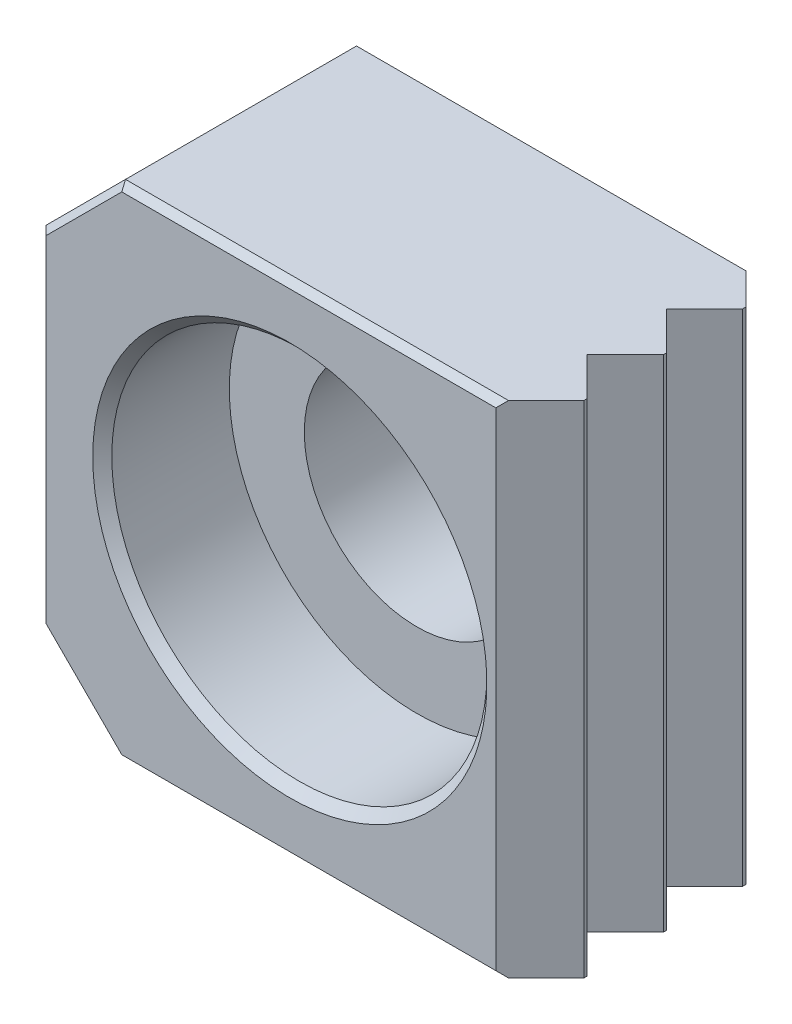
ISO-10303-21;
HEADER;
FILE_DESCRIPTION(('STEP AP214'),'2;1');
FILE_NAME('part.step','',(''),(''),'','','');
FILE_SCHEMA(('AUTOMOTIVE_DESIGN { 1 0 10303 214 1 1 1 1 }'));
ENDSEC;
DATA;
#1=APPLICATION_CONTEXT('core data for automotive mechanical design processes');
#2=APPLICATION_PROTOCOL_DEFINITION('international standard','automotive_design',2000,#1);
#3=PRODUCT_CONTEXT('',#1,'mechanical');
#4=PRODUCT('Part','Part','',(#3));
#5=PRODUCT_RELATED_PRODUCT_CATEGORY('part','',(#4));
#6=PRODUCT_DEFINITION_FORMATION('','',#4);
#7=PRODUCT_DEFINITION_CONTEXT('part definition',#1,'design');
#8=PRODUCT_DEFINITION('design','',#6,#7);
#9=PRODUCT_DEFINITION_SHAPE('','',#8);
#10=(LENGTH_UNIT() NAMED_UNIT(*) SI_UNIT(.MILLI.,.METRE.));
#11=(NAMED_UNIT(*) PLANE_ANGLE_UNIT() SI_UNIT($,.RADIAN.));
#12=(NAMED_UNIT(*) SI_UNIT($,.STERADIAN.) SOLID_ANGLE_UNIT());
#13=UNCERTAINTY_MEASURE_WITH_UNIT(LENGTH_MEASURE(1.E-05),#10,'distance_accuracy_value','');
#14=(GEOMETRIC_REPRESENTATION_CONTEXT(3) GLOBAL_UNCERTAINTY_ASSIGNED_CONTEXT((#13)) GLOBAL_UNIT_ASSIGNED_CONTEXT((#10,
#11,#12)) REPRESENTATION_CONTEXT('',''));
#15=CARTESIAN_POINT('',(0.,0.,0.));
#16=DIRECTION('',(0.,0.,1.));
#17=DIRECTION('',(1.,0.,0.));
#18=AXIS2_PLACEMENT_3D('',#15,#16,#17);
#19=CARTESIAN_POINT('',(10.,-10.,10.));
#20=DIRECTION('',(-1.,0.,0.));
#21=DIRECTION('',(0.,-1.,0.));
#22=AXIS2_PLACEMENT_3D('',#19,#20,#21);
#23=PLANE('',#22);
#24=DIRECTION('',(0.,-1.,0.));
#25=VECTOR('',#24,1.);
#26=CARTESIAN_POINT('',(10.,-10.,8.1115));
#27=LINE('',#26,#25);
#28=CARTESIAN_POINT('',(10.,10.,8.1115));
#29=VERTEX_POINT('',#28);
#30=CARTESIAN_POINT('',(10.,-10.,8.1115));
#31=VERTEX_POINT('',#30);
#32=EDGE_CURVE('E214',#29,#31,#27,.T.);
#33=ORIENTED_EDGE('',*,*,#32,.F.);
#34=DIRECTION('',(0.,0.,-1.));
#35=VECTOR('',#34,1.);
#36=CARTESIAN_POINT('',(10.,10.,10.));
#37=LINE('',#36,#35);
#38=CARTESIAN_POINT('',(10.,10.,8.2385));
#39=VERTEX_POINT('',#38);
#40=EDGE_CURVE('E226',#39,#29,#37,.T.);
#41=ORIENTED_EDGE('',*,*,#40,.F.);
#42=DIRECTION('',(0.,1.,0.));
#43=VECTOR('',#42,1.);
#44=CARTESIAN_POINT('',(10.,-10.,8.2385));
#45=LINE('',#44,#43);
#46=CARTESIAN_POINT('',(10.,-10.,8.2385));
#47=VERTEX_POINT('',#46);
#48=EDGE_CURVE('E207',#47,#39,#45,.T.);
#49=ORIENTED_EDGE('',*,*,#48,.F.);
#50=DIRECTION('',(0.,0.,-1.));
#51=VECTOR('',#50,1.);
#52=CARTESIAN_POINT('',(10.,-10.,10.));
#53=LINE('',#52,#51);
#54=EDGE_CURVE('E221',#47,#31,#53,.T.);
#55=ORIENTED_EDGE('',*,*,#54,.T.);
#56=EDGE_LOOP('',(#33,#41,#49,#55));
#57=FACE_BOUND('',#56,.T.);
#58=ADVANCED_FACE('F14',(#57),#23,.F.);
#59=CARTESIAN_POINT('',(10.,-10.,1.8885));
#60=VERTEX_POINT('',#59);
#61=CARTESIAN_POINT('',(10.,-10.,1.7615));
#62=VERTEX_POINT('',#61);
#63=EDGE_CURVE('E180',#60,#62,#53,.T.);
#64=ORIENTED_EDGE('',*,*,#63,.T.);
#65=DIRECTION('',(0.,1.,0.));
#66=VECTOR('',#65,1.);
#67=CARTESIAN_POINT('',(10.,-10.,1.7615));
#68=LINE('',#67,#66);
#69=CARTESIAN_POINT('',(10.,10.,1.7615));
#70=VERTEX_POINT('',#69);
#71=EDGE_CURVE('E172',#62,#70,#68,.T.);
#72=ORIENTED_EDGE('',*,*,#71,.T.);
#73=CARTESIAN_POINT('',(10.,10.,1.8885));
#74=VERTEX_POINT('',#73);
#75=EDGE_CURVE('E222',#74,#70,#37,.T.);
#76=ORIENTED_EDGE('',*,*,#75,.F.);
#77=DIRECTION('',(0.,-1.,0.));
#78=VECTOR('',#77,1.);
#79=CARTESIAN_POINT('',(10.,-10.,1.8885));
#80=LINE('',#79,#78);
#81=EDGE_CURVE('E212',#74,#60,#80,.T.);
#82=ORIENTED_EDGE('',*,*,#81,.T.);
#83=EDGE_LOOP('',(#64,#72,#76,#82));
#84=FACE_BOUND('',#83,.T.);
#85=ADVANCED_FACE('F312',(#84),#23,.F.);
#86=CARTESIAN_POINT('',(10.,-10.,5.0635));
#87=VERTEX_POINT('',#86);
#88=CARTESIAN_POINT('',(10.,-10.,4.9365));
#89=VERTEX_POINT('',#88);
#90=EDGE_CURVE('E220',#87,#89,#53,.T.);
#91=ORIENTED_EDGE('',*,*,#90,.T.);
#92=DIRECTION('',(0.,1.,0.));
#93=VECTOR('',#92,1.);
#94=CARTESIAN_POINT('',(10.,-10.,4.9365));
#95=LINE('',#94,#93);
#96=CARTESIAN_POINT('',(10.,10.,4.9365));
#97=VERTEX_POINT('',#96);
#98=EDGE_CURVE('E158',#89,#97,#95,.T.);
#99=ORIENTED_EDGE('',*,*,#98,.T.);
#100=CARTESIAN_POINT('',(10.,10.,5.0635));
#101=VERTEX_POINT('',#100);
#102=EDGE_CURVE('E225',#101,#97,#37,.T.);
#103=ORIENTED_EDGE('',*,*,#102,.F.);
#104=DIRECTION('',(0.,1.,0.));
#105=VECTOR('',#104,1.);
#106=CARTESIAN_POINT('',(10.,-10.,5.0635));
#107=LINE('',#106,#105);
#108=EDGE_CURVE('E209',#87,#101,#107,.T.);
#109=ORIENTED_EDGE('',*,*,#108,.F.);
#110=EDGE_LOOP('',(#91,#99,#103,#109));
#111=FACE_BOUND('',#110,.T.);
#112=ADVANCED_FACE('F314',(#111),#23,.F.);
#113=CARTESIAN_POINT('',(-10.,10.,10.));
#114=DIRECTION('',(0.,1.,0.));
#115=DIRECTION('',(-1.,0.,0.));
#116=AXIS2_PLACEMENT_3D('',#113,#114,#115);
#117=PLANE('',#116);
#118=DIRECTION('',(0.,0.,1.));
#119=VECTOR('',#118,1.);
#120=CARTESIAN_POINT('',(-6.825,10.,10.));
#121=LINE('',#120,#119);
#122=CARTESIAN_POINT('',(-6.825,10.,0.508));
#123=VERTEX_POINT('',#122);
#124=CARTESIAN_POINT('',(-6.825,10.,9.746));
#125=VERTEX_POINT('',#124);
#126=EDGE_CURVE('E239',#123,#125,#121,.T.);
#127=ORIENTED_EDGE('',*,*,#126,.T.);
#128=DIRECTION('',(1.,0.,0.));
#129=VECTOR('',#128,1.);
#130=CARTESIAN_POINT('',(8.23850000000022,10.,9.746));
#131=LINE('',#130,#129);
#132=CARTESIAN_POINT('',(8.4925000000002,10.,9.746));
#133=VERTEX_POINT('',#132);
#134=EDGE_CURVE('E295',#125,#133,#131,.T.);
#135=ORIENTED_EDGE('',*,*,#134,.T.);
#136=DIRECTION('',(-0.707106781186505,0.,0.70710678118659));
#137=VECTOR('',#136,1.);
#138=CARTESIAN_POINT('',(10.0635,10.,8.175));
#139=LINE('',#138,#137);
#140=EDGE_CURVE('E192',#39,#133,#139,.T.);
#141=ORIENTED_EDGE('',*,*,#140,.F.);
#142=ORIENTED_EDGE('',*,*,#40,.T.);
#143=DIRECTION('',(0.707106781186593,0.,0.707106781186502));
#144=VECTOR('',#143,1.);
#145=CARTESIAN_POINT('',(8.476,10.,6.58750000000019));
#146=LINE('',#145,#144);
#147=CARTESIAN_POINT('',(8.476,10.,6.58750000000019));
#148=VERTEX_POINT('',#147);
#149=EDGE_CURVE('E190',#148,#29,#146,.T.);
#150=ORIENTED_EDGE('',*,*,#149,.F.);
#151=DIRECTION('',(-0.707106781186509,0.,0.707106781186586));
#152=VECTOR('',#151,1.);
#153=CARTESIAN_POINT('',(10.0635,10.,5.));
#154=LINE('',#153,#152);
#155=EDGE_CURVE('E201',#101,#148,#154,.T.);
#156=ORIENTED_EDGE('',*,*,#155,.F.);
#157=ORIENTED_EDGE('',*,*,#102,.T.);
#158=DIRECTION('',(-0.707106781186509,0.,-0.707106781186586));
#159=VECTOR('',#158,1.);
#160=CARTESIAN_POINT('',(10.0635,10.,5.));
#161=LINE('',#160,#159);
#162=CARTESIAN_POINT('',(8.476,10.,3.41249999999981));
#163=VERTEX_POINT('',#162);
#164=EDGE_CURVE('E199',#97,#163,#161,.T.);
#165=ORIENTED_EDGE('',*,*,#164,.T.);
#166=DIRECTION('',(0.707106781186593,0.,-0.707106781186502));
#167=VECTOR('',#166,1.);
#168=CARTESIAN_POINT('',(8.476,10.,3.41249999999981));
#169=LINE('',#168,#167);
#170=EDGE_CURVE('E170',#163,#74,#169,.T.);
#171=ORIENTED_EDGE('',*,*,#170,.T.);
#172=ORIENTED_EDGE('',*,*,#75,.T.);
#173=DIRECTION('',(-0.707106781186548,0.,-0.707106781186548));
#174=VECTOR('',#173,1.);
#175=CARTESIAN_POINT('',(10.0635,10.,1.825));
#176=LINE('',#175,#174);
#177=CARTESIAN_POINT('',(8.7465,10.,0.508));
#178=VERTEX_POINT('',#177);
#179=EDGE_CURVE('E195',#70,#178,#176,.T.);
#180=ORIENTED_EDGE('',*,*,#179,.T.);
#181=DIRECTION('',(-1.,0.,0.));
#182=VECTOR('',#181,1.);
#183=CARTESIAN_POINT('',(-10.,10.,0.508));
#184=LINE('',#183,#182);
#185=EDGE_CURVE('E272',#178,#123,#184,.T.);
#186=ORIENTED_EDGE('',*,*,#185,.T.);
#187=EDGE_LOOP('',(#127,#135,#141,#142,#150,#156,#157,#165,#171,#172,#180,#186));
#188=FACE_BOUND('',#187,.T.);
#189=ADVANCED_FACE('F322',(#188),#117,.T.);
#190=CARTESIAN_POINT('',(10.,-10.,10.));
#191=DIRECTION('',(0.,-1.,0.));
#192=DIRECTION('',(1.,0.,0.));
#193=AXIS2_PLACEMENT_3D('',#190,#191,#192);
#194=PLANE('',#193);
#195=DIRECTION('',(-0.707106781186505,0.,0.70710678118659));
#196=VECTOR('',#195,1.);
#197=CARTESIAN_POINT('',(10.0635,-10.,8.175));
#198=LINE('',#197,#196);
#199=CARTESIAN_POINT('',(8.4925000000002,-10.,9.746));
#200=VERTEX_POINT('',#199);
#201=EDGE_CURVE('E184',#47,#200,#198,.T.);
#202=ORIENTED_EDGE('',*,*,#201,.T.);
#203=DIRECTION('',(-1.,0.,0.));
#204=VECTOR('',#203,1.);
#205=CARTESIAN_POINT('',(-6.825,-10.,9.746));
#206=LINE('',#205,#204);
#207=CARTESIAN_POINT('',(-6.825,-10.,9.746));
#208=VERTEX_POINT('',#207);
#209=EDGE_CURVE('E274',#200,#208,#206,.T.);
#210=ORIENTED_EDGE('',*,*,#209,.T.);
#211=DIRECTION('',(0.,0.,-1.));
#212=VECTOR('',#211,1.);
#213=CARTESIAN_POINT('',(-6.825,-10.,0.));
#214=LINE('',#213,#212);
#215=CARTESIAN_POINT('',(-6.825,-10.,0.508));
#216=VERTEX_POINT('',#215);
#217=EDGE_CURVE('E233',#208,#216,#214,.T.);
#218=ORIENTED_EDGE('',*,*,#217,.T.);
#219=DIRECTION('',(1.,0.,0.));
#220=VECTOR('',#219,1.);
#221=CARTESIAN_POINT('',(10.,-10.,0.508));
#222=LINE('',#221,#220);
#223=CARTESIAN_POINT('',(8.7465,-10.,0.508));
#224=VERTEX_POINT('',#223);
#225=EDGE_CURVE('E258',#216,#224,#222,.T.);
#226=ORIENTED_EDGE('',*,*,#225,.T.);
#227=DIRECTION('',(-0.707106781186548,0.,-0.707106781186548));
#228=VECTOR('',#227,1.);
#229=CARTESIAN_POINT('',(10.0635,-10.,1.825));
#230=LINE('',#229,#228);
#231=EDGE_CURVE('E181',#62,#224,#230,.T.);
#232=ORIENTED_EDGE('',*,*,#231,.F.);
#233=ORIENTED_EDGE('',*,*,#63,.F.);
#234=DIRECTION('',(0.707106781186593,0.,-0.707106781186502));
#235=VECTOR('',#234,1.);
#236=CARTESIAN_POINT('',(8.476,-10.,3.41249999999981));
#237=LINE('',#236,#235);
#238=CARTESIAN_POINT('',(8.476,-10.,3.41249999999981));
#239=VERTEX_POINT('',#238);
#240=EDGE_CURVE('E164',#239,#60,#237,.T.);
#241=ORIENTED_EDGE('',*,*,#240,.F.);
#242=DIRECTION('',(-0.707106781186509,0.,-0.707106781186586));
#243=VECTOR('',#242,1.);
#244=CARTESIAN_POINT('',(10.0635,-10.,5.));
#245=LINE('',#244,#243);
#246=EDGE_CURVE('E152',#89,#239,#245,.T.);
#247=ORIENTED_EDGE('',*,*,#246,.F.);
#248=ORIENTED_EDGE('',*,*,#90,.F.);
#249=DIRECTION('',(-0.707106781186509,0.,0.707106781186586));
#250=VECTOR('',#249,1.);
#251=CARTESIAN_POINT('',(10.0635,-10.,5.));
#252=LINE('',#251,#250);
#253=CARTESIAN_POINT('',(8.476,-10.,6.58750000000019));
#254=VERTEX_POINT('',#253);
#255=EDGE_CURVE('E163',#87,#254,#252,.T.);
#256=ORIENTED_EDGE('',*,*,#255,.T.);
#257=DIRECTION('',(0.707106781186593,0.,0.707106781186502));
#258=VECTOR('',#257,1.);
#259=CARTESIAN_POINT('',(8.476,-10.,6.58750000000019));
#260=LINE('',#259,#258);
#261=EDGE_CURVE('E338',#254,#31,#260,.T.);
#262=ORIENTED_EDGE('',*,*,#261,.T.);
#263=ORIENTED_EDGE('',*,*,#54,.F.);
#264=EDGE_LOOP('',(#202,#210,#218,#226,#232,#233,#241,#247,#248,#256,#262,#263));
#265=FACE_BOUND('',#264,.T.);
#266=ADVANCED_FACE('F177',(#265),#194,.T.);
#267=CARTESIAN_POINT('',(10.,10.,10.));
#268=DIRECTION('',(0.,0.,-1.));
#269=DIRECTION('',(1.,0.,0.));
#270=AXIS2_PLACEMENT_3D('',#267,#268,#269);
#271=PLANE('',#270);
#272=CARTESIAN_POINT('',(0.,0.,10.));
#273=DIRECTION('',(0.,0.,-1.));
#274=DIRECTION('',(-1.,0.,0.));
#275=AXIS2_PLACEMENT_3D('',#272,#273,#274);
#276=CIRCLE('',#275,7.881);
#277=CARTESIAN_POINT('',(-7.881,0.,10.));
#278=VERTEX_POINT('',#277);
#279=EDGE_CURVE('E9',#278,#278,#276,.T.);
#280=ORIENTED_EDGE('',*,*,#279,.T.);
#281=EDGE_LOOP('',(#280));
#282=FACE_BOUND('',#281,.T.);
#283=DIRECTION('',(0.707106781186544,-0.707106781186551,0.));
#284=VECTOR('',#283,1.);
#285=CARTESIAN_POINT('',(-6.64539487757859,-9.82039487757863,10.));
#286=LINE('',#285,#284);
#287=CARTESIAN_POINT('',(-9.746,-6.71978975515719,10.));
#288=VERTEX_POINT('',#287);
#289=CARTESIAN_POINT('',(-6.71978975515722,-9.746,10.));
#290=VERTEX_POINT('',#289);
#291=EDGE_CURVE('E283',#288,#290,#286,.T.);
#292=ORIENTED_EDGE('',*,*,#291,.T.);
#293=DIRECTION('',(1.,0.,0.));
#294=VECTOR('',#293,1.);
#295=CARTESIAN_POINT('',(8.23850000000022,-9.746,10.));
#296=LINE('',#295,#294);
#297=CARTESIAN_POINT('',(8.23850000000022,-9.746,10.));
#298=VERTEX_POINT('',#297);
#299=EDGE_CURVE('E285',#290,#298,#296,.T.);
#300=ORIENTED_EDGE('',*,*,#299,.T.);
#301=DIRECTION('',(0.,-1.,0.));
#302=VECTOR('',#301,1.);
#303=CARTESIAN_POINT('',(8.23850000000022,10.,10.));
#304=LINE('',#303,#302);
#305=CARTESIAN_POINT('',(8.23850000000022,9.746,10.));
#306=VERTEX_POINT('',#305);
#307=EDGE_CURVE('E230',#306,#298,#304,.T.);
#308=ORIENTED_EDGE('',*,*,#307,.F.);
#309=DIRECTION('',(-1.,0.,0.));
#310=VECTOR('',#309,1.);
#311=CARTESIAN_POINT('',(-6.825,9.746,10.));
#312=LINE('',#311,#310);
#313=CARTESIAN_POINT('',(-6.71978975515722,9.746,10.));
#314=VERTEX_POINT('',#313);
#315=EDGE_CURVE('E277',#306,#314,#312,.T.);
#316=ORIENTED_EDGE('',*,*,#315,.T.);
#317=DIRECTION('',(-0.707106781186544,-0.707106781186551,0.));
#318=VECTOR('',#317,1.);
#319=CARTESIAN_POINT('',(-9.82039487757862,6.64539487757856,10.));
#320=LINE('',#319,#318);
#321=CARTESIAN_POINT('',(-9.746,6.71978975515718,10.));
#322=VERTEX_POINT('',#321);
#323=EDGE_CURVE('E279',#314,#322,#320,.T.);
#324=ORIENTED_EDGE('',*,*,#323,.T.);
#325=DIRECTION('',(0.,-1.,0.));
#326=VECTOR('',#325,1.);
#327=CARTESIAN_POINT('',(-9.746,10.,10.));
#328=LINE('',#327,#326);
#329=EDGE_CURVE('E281',#322,#288,#328,.T.);
#330=ORIENTED_EDGE('',*,*,#329,.T.);
#331=EDGE_LOOP('',(#292,#300,#308,#316,#324,#330));
#332=FACE_BOUND('',#331,.T.);
#333=ADVANCED_FACE('F388',(#282,#332),#271,.F.);
#334=CARTESIAN_POINT('',(-10.,10.,10.));
#335=DIRECTION('',(1.,0.,0.));
#336=DIRECTION('',(0.,0.,1.));
#337=AXIS2_PLACEMENT_3D('',#334,#335,#336);
#338=PLANE('',#337);
#339=DIRECTION('',(0.,0.,1.));
#340=VECTOR('',#339,1.);
#341=CARTESIAN_POINT('',(-10.,-6.825,10.));
#342=LINE('',#341,#340);
#343=CARTESIAN_POINT('',(-10.,-6.825,0.508));
#344=VERTEX_POINT('',#343);
#345=CARTESIAN_POINT('',(-10.,-6.825,9.746));
#346=VERTEX_POINT('',#345);
#347=EDGE_CURVE('E237',#344,#346,#342,.T.);
#348=ORIENTED_EDGE('',*,*,#347,.T.);
#349=DIRECTION('',(0.,1.,0.));
#350=VECTOR('',#349,1.);
#351=CARTESIAN_POINT('',(-10.,10.,9.746));
#352=LINE('',#351,#350);
#353=CARTESIAN_POINT('',(-10.,6.825,9.746));
#354=VERTEX_POINT('',#353);
#355=EDGE_CURVE('E37',#346,#354,#352,.T.);
#356=ORIENTED_EDGE('',*,*,#355,.T.);
#357=DIRECTION('',(0.,0.,-1.));
#358=VECTOR('',#357,1.);
#359=CARTESIAN_POINT('',(-10.,6.825,0.));
#360=LINE('',#359,#358);
#361=CARTESIAN_POINT('',(-10.,6.825,0.508));
#362=VERTEX_POINT('',#361);
#363=EDGE_CURVE('E235',#354,#362,#360,.T.);
#364=ORIENTED_EDGE('',*,*,#363,.T.);
#365=DIRECTION('',(0.,-1.,0.));
#366=VECTOR('',#365,1.);
#367=CARTESIAN_POINT('',(-10.,-6.825,0.508));
#368=LINE('',#367,#366);
#369=EDGE_CURVE('E267',#362,#344,#368,.T.);
#370=ORIENTED_EDGE('',*,*,#369,.T.);
#371=EDGE_LOOP('',(#348,#356,#364,#370));
#372=FACE_BOUND('',#371,.T.);
#373=ADVANCED_FACE('F382',(#372),#338,.F.);
#374=CARTESIAN_POINT('',(10.,10.,0.));
#375=DIRECTION('',(0.,0.,-1.));
#376=DIRECTION('',(1.,0.,0.));
#377=AXIS2_PLACEMENT_3D('',#374,#375,#376);
#378=PLANE('',#377);
#379=CARTESIAN_POINT('',(0.,0.,0.));
#380=DIRECTION('',(0.,0.,-1.));
#381=DIRECTION('',(1.,0.,0.));
#382=AXIS2_PLACEMENT_3D('',#379,#380,#381);
#383=CIRCLE('',#382,4.881);
#384=CARTESIAN_POINT('',(4.881,0.,0.));
#385=VERTEX_POINT('',#384);
#386=EDGE_CURVE('E241',#385,#385,#383,.F.);
#387=ORIENTED_EDGE('',*,*,#386,.T.);
#388=EDGE_LOOP('',(#387));
#389=FACE_BOUND('',#388,.T.);
#390=DIRECTION('',(0.,1.,0.));
#391=VECTOR('',#390,1.);
#392=CARTESIAN_POINT('',(8.2385,10.,0.));
#393=LINE('',#392,#391);
#394=CARTESIAN_POINT('',(8.2385,-9.492,0.));
#395=VERTEX_POINT('',#394);
#396=CARTESIAN_POINT('',(8.2385,9.492,0.));
#397=VERTEX_POINT('',#396);
#398=EDGE_CURVE('E227',#395,#397,#393,.T.);
#399=ORIENTED_EDGE('',*,*,#398,.F.);
#400=DIRECTION('',(-1.,0.,0.));
#401=VECTOR('',#400,1.);
#402=CARTESIAN_POINT('',(10.,-9.492,0.));
#403=LINE('',#402,#401);
#404=CARTESIAN_POINT('',(-6.61457951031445,-9.492,0.));
#405=VERTEX_POINT('',#404);
#406=EDGE_CURVE('E255',#395,#405,#403,.T.);
#407=ORIENTED_EDGE('',*,*,#406,.T.);
#408=DIRECTION('',(-0.707106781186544,0.707106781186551,0.));
#409=VECTOR('',#408,1.);
#410=CARTESIAN_POINT('',(-8.05328975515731,-8.05328975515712,0.));
#411=LINE('',#410,#409);
#412=CARTESIAN_POINT('',(-9.492,-6.61457951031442,0.));
#413=VERTEX_POINT('',#412);
#414=EDGE_CURVE('E253',#405,#413,#411,.T.);
#415=ORIENTED_EDGE('',*,*,#414,.T.);
#416=DIRECTION('',(0.,1.,0.));
#417=VECTOR('',#416,1.);
#418=CARTESIAN_POINT('',(-9.492,6.825,0.));
#419=LINE('',#418,#417);
#420=CARTESIAN_POINT('',(-9.492,6.61457951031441,0.));
#421=VERTEX_POINT('',#420);
#422=EDGE_CURVE('E251',#413,#421,#419,.T.);
#423=ORIENTED_EDGE('',*,*,#422,.T.);
#424=DIRECTION('',(0.707106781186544,0.707106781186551,0.));
#425=VECTOR('',#424,1.);
#426=CARTESIAN_POINT('',(1.9467102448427,18.0532897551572,0.));
#427=LINE('',#426,#425);
#428=CARTESIAN_POINT('',(-6.61457951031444,9.492,0.));
#429=VERTEX_POINT('',#428);
#430=EDGE_CURVE('E249',#421,#429,#427,.T.);
#431=ORIENTED_EDGE('',*,*,#430,.T.);
#432=DIRECTION('',(1.,0.,0.));
#433=VECTOR('',#432,1.);
#434=CARTESIAN_POINT('',(10.,9.492,0.));
#435=LINE('',#434,#433);
#436=EDGE_CURVE('E247',#429,#397,#435,.T.);
#437=ORIENTED_EDGE('',*,*,#436,.T.);
#438=EDGE_LOOP('',(#399,#407,#415,#423,#431,#437));
#439=FACE_BOUND('',#438,.T.);
#440=ADVANCED_FACE('F372',(#389,#439),#378,.T.);
#441=CARTESIAN_POINT('',(0.,0.,4.92));
#442=DIRECTION('',(0.,0.,1.));
#443=DIRECTION('',(-1.,0.,0.));
#444=AXIS2_PLACEMENT_3D('',#441,#442,#443);
#445=PLANE('',#444);
#446=CARTESIAN_POINT('',(0.,0.,4.92));
#447=DIRECTION('',(0.,0.,1.));
#448=DIRECTION('',(-1.,0.,0.));
#449=AXIS2_PLACEMENT_3D('',#446,#447,#448);
#450=CIRCLE('',#449,4.5);
#451=CARTESIAN_POINT('',(-4.5,0.,4.92));
#452=VERTEX_POINT('',#451);
#453=EDGE_CURVE('E216',#452,#452,#450,.T.);
#454=ORIENTED_EDGE('',*,*,#453,.F.);
#455=EDGE_LOOP('',(#454));
#456=FACE_BOUND('',#455,.T.);
#457=CARTESIAN_POINT('',(0.,0.,4.92));
#458=DIRECTION('',(0.,0.,1.));
#459=DIRECTION('',(1.,0.,0.));
#460=AXIS2_PLACEMENT_3D('',#457,#458,#459);
#461=CIRCLE('',#460,7.5);
#462=CARTESIAN_POINT('',(7.5,0.,4.92));
#463=VERTEX_POINT('',#462);
#464=EDGE_CURVE('E365',#463,#463,#461,.F.);
#465=ORIENTED_EDGE('',*,*,#464,.F.);
#466=EDGE_LOOP('',(#465));
#467=FACE_BOUND('',#466,.T.);
#468=ADVANCED_FACE('F369',(#456,#467),#445,.T.);
#469=CARTESIAN_POINT('',(0.,0.,0.));
#470=DIRECTION('',(0.,0.,1.));
#471=DIRECTION('',(-1.,0.,0.));
#472=AXIS2_PLACEMENT_3D('',#469,#470,#471);
#473=CYLINDRICAL_SURFACE('',#472,4.5);
#474=CARTESIAN_POINT('',(0.,0.,0.381));
#475=DIRECTION('',(0.,0.,-1.));
#476=DIRECTION('',(1.,0.,0.));
#477=AXIS2_PLACEMENT_3D('',#474,#475,#476);
#478=CIRCLE('',#477,4.5);
#479=CARTESIAN_POINT('',(4.5,0.,0.381));
#480=VERTEX_POINT('',#479);
#481=EDGE_CURVE('E244',#480,#480,#478,.T.);
#482=ORIENTED_EDGE('',*,*,#481,.T.);
#483=EDGE_LOOP('',(#482));
#484=FACE_BOUND('',#483,.T.);
#485=ORIENTED_EDGE('',*,*,#453,.T.);
#486=EDGE_LOOP('',(#485));
#487=FACE_BOUND('',#486,.T.);
#488=ADVANCED_FACE('F371',(#484,#487),#473,.F.);
#489=CARTESIAN_POINT('',(10.0635,10.,1.825));
#490=DIRECTION('',(-0.707106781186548,0.,0.707106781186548));
#491=DIRECTION('',(-0.707106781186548,0.,-0.707106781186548));
#492=AXIS2_PLACEMENT_3D('',#489,#490,#491);
#493=PLANE('',#492);
#494=ORIENTED_EDGE('',*,*,#231,.T.);
#495=DIRECTION('',(0.577350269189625,-0.577350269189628,0.577350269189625));
#496=VECTOR('',#495,1.);
#497=CARTESIAN_POINT('',(8.82566666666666,-10.0791666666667,0.587166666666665));
#498=LINE('',#497,#496);
#499=EDGE_CURVE('E262',#224,#395,#498,.F.);
#500=ORIENTED_EDGE('',*,*,#499,.T.);
#501=ORIENTED_EDGE('',*,*,#398,.T.);
#502=DIRECTION('',(-0.577350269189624,-0.57735026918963,-0.577350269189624));
#503=VECTOR('',#502,1.);
#504=CARTESIAN_POINT('',(8.82566666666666,10.0791666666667,0.587166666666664));
#505=LINE('',#504,#503);
#506=EDGE_CURVE('E260',#397,#178,#505,.F.);
#507=ORIENTED_EDGE('',*,*,#506,.T.);
#508=ORIENTED_EDGE('',*,*,#179,.F.);
#509=ORIENTED_EDGE('',*,*,#71,.F.);
#510=EDGE_LOOP('',(#494,#500,#501,#507,#508,#509));
#511=FACE_BOUND('',#510,.T.);
#512=ADVANCED_FACE('F379',(#511),#493,.F.);
#513=CARTESIAN_POINT('',(10.0635,10.,8.175));
#514=DIRECTION('',(0.70710678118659,0.,0.707106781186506));
#515=DIRECTION('',(-0.707106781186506,0.,0.70710678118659));
#516=AXIS2_PLACEMENT_3D('',#513,#514,#515);
#517=PLANE('',#516);
#518=ORIENTED_EDGE('',*,*,#307,.T.);
#519=DIRECTION('',(0.577350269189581,-0.577350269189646,-0.57735026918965));
#520=VECTOR('',#519,1.);
#521=CARTESIAN_POINT('',(2.87316666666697,-4.38066666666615,15.3653333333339));
#522=LINE('',#521,#520);
#523=EDGE_CURVE('E289',#298,#200,#522,.T.);
#524=ORIENTED_EDGE('',*,*,#523,.T.);
#525=ORIENTED_EDGE('',*,*,#201,.F.);
#526=ORIENTED_EDGE('',*,*,#48,.T.);
#527=ORIENTED_EDGE('',*,*,#140,.T.);
#528=DIRECTION('',(-0.577350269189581,-0.577350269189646,0.57735026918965));
#529=VECTOR('',#528,1.);
#530=CARTESIAN_POINT('',(9.53983333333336,11.0473333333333,8.6986666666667));
#531=LINE('',#530,#529);
#532=EDGE_CURVE('E287',#133,#306,#531,.T.);
#533=ORIENTED_EDGE('',*,*,#532,.T.);
#534=EDGE_LOOP('',(#518,#524,#525,#526,#527,#533));
#535=FACE_BOUND('',#534,.T.);
#536=ADVANCED_FACE('F417',(#535),#517,.T.);
#537=CARTESIAN_POINT('',(10.0635,10.,5.));
#538=DIRECTION('',(0.707106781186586,0.,0.707106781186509));
#539=DIRECTION('',(-0.707106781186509,0.,0.707106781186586));
#540=AXIS2_PLACEMENT_3D('',#537,#538,#539);
#541=PLANE('',#540);
#542=ORIENTED_EDGE('',*,*,#108,.T.);
#543=ORIENTED_EDGE('',*,*,#155,.T.);
#544=DIRECTION('',(0.,-1.,0.));
#545=VECTOR('',#544,1.);
#546=CARTESIAN_POINT('',(8.476,10.,6.58750000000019));
#547=LINE('',#546,#545);
#548=EDGE_CURVE('E173',#148,#254,#547,.T.);
#549=ORIENTED_EDGE('',*,*,#548,.T.);
#550=ORIENTED_EDGE('',*,*,#255,.F.);
#551=EDGE_LOOP('',(#542,#543,#549,#550));
#552=FACE_BOUND('',#551,.T.);
#553=ADVANCED_FACE('F467',(#552),#541,.T.);
#554=CARTESIAN_POINT('',(8.476,10.,6.58750000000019));
#555=DIRECTION('',(0.707106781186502,0.,-0.707106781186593));
#556=DIRECTION('',(0.707106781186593,0.,0.707106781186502));
#557=AXIS2_PLACEMENT_3D('',#554,#555,#556);
#558=PLANE('',#557);
#559=ORIENTED_EDGE('',*,*,#32,.T.);
#560=ORIENTED_EDGE('',*,*,#261,.F.);
#561=ORIENTED_EDGE('',*,*,#548,.F.);
#562=ORIENTED_EDGE('',*,*,#149,.T.);
#563=EDGE_LOOP('',(#559,#560,#561,#562));
#564=FACE_BOUND('',#563,.T.);
#565=ADVANCED_FACE('F470',(#564),#558,.T.);
#566=CARTESIAN_POINT('',(8.476,10.,3.41249999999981));
#567=DIRECTION('',(-0.707106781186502,0.,-0.707106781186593));
#568=DIRECTION('',(0.707106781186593,0.,-0.707106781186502));
#569=AXIS2_PLACEMENT_3D('',#566,#567,#568);
#570=PLANE('',#569);
#571=ORIENTED_EDGE('',*,*,#170,.F.);
#572=DIRECTION('',(0.,-1.,0.));
#573=VECTOR('',#572,1.);
#574=CARTESIAN_POINT('',(8.476,10.,3.41249999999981));
#575=LINE('',#574,#573);
#576=EDGE_CURVE('E155',#163,#239,#575,.T.);
#577=ORIENTED_EDGE('',*,*,#576,.T.);
#578=ORIENTED_EDGE('',*,*,#240,.T.);
#579=ORIENTED_EDGE('',*,*,#81,.F.);
#580=EDGE_LOOP('',(#571,#577,#578,#579));
#581=FACE_BOUND('',#580,.T.);
#582=ADVANCED_FACE('F167',(#581),#570,.F.);
#583=CARTESIAN_POINT('',(10.0635,10.,5.));
#584=DIRECTION('',(-0.707106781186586,0.,0.707106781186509));
#585=DIRECTION('',(-0.707106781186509,0.,-0.707106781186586));
#586=AXIS2_PLACEMENT_3D('',#583,#584,#585);
#587=PLANE('',#586);
#588=ORIENTED_EDGE('',*,*,#246,.T.);
#589=ORIENTED_EDGE('',*,*,#576,.F.);
#590=ORIENTED_EDGE('',*,*,#164,.F.);
#591=ORIENTED_EDGE('',*,*,#98,.F.);
#592=EDGE_LOOP('',(#588,#589,#590,#591));
#593=FACE_BOUND('',#592,.T.);
#594=ADVANCED_FACE('F154',(#593),#587,.F.);
#595=CARTESIAN_POINT('',(-6.825,-10.,10.));
#596=DIRECTION('',(-0.707106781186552,-0.707106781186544,0.));
#597=DIRECTION('',(0.707106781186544,-0.707106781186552,0.));
#598=AXIS2_PLACEMENT_3D('',#595,#596,#597);
#599=PLANE('',#598);
#600=ORIENTED_EDGE('',*,*,#217,.F.);
#601=DIRECTION('',(-0.707106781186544,0.707106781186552,0.));
#602=VECTOR('',#601,1.);
#603=CARTESIAN_POINT('',(-10.,-6.825,9.746));
#604=LINE('',#603,#602);
#605=EDGE_CURVE('E291',#208,#346,#604,.T.);
#606=ORIENTED_EDGE('',*,*,#605,.T.);
#607=ORIENTED_EDGE('',*,*,#347,.F.);
#608=DIRECTION('',(0.707106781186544,-0.707106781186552,0.));
#609=VECTOR('',#608,1.);
#610=CARTESIAN_POINT('',(-6.825,-10.,0.508));
#611=LINE('',#610,#609);
#612=EDGE_CURVE('E264',#344,#216,#611,.T.);
#613=ORIENTED_EDGE('',*,*,#612,.T.);
#614=EDGE_LOOP('',(#600,#606,#607,#613));
#615=FACE_BOUND('',#614,.T.);
#616=ADVANCED_FACE('F464',(#615),#599,.T.);
#617=CARTESIAN_POINT('',(-10.,6.825,10.));
#618=DIRECTION('',(-0.707106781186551,0.707106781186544,0.));
#619=DIRECTION('',(-0.707106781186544,-0.707106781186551,0.));
#620=AXIS2_PLACEMENT_3D('',#617,#618,#619);
#621=PLANE('',#620);
#622=ORIENTED_EDGE('',*,*,#363,.F.);
#623=DIRECTION('',(0.707106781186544,0.707106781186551,0.));
#624=VECTOR('',#623,1.);
#625=CARTESIAN_POINT('',(-6.825,10.,9.746));
#626=LINE('',#625,#624);
#627=EDGE_CURVE('E29',#354,#125,#626,.T.);
#628=ORIENTED_EDGE('',*,*,#627,.T.);
#629=ORIENTED_EDGE('',*,*,#126,.F.);
#630=DIRECTION('',(-0.707106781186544,-0.707106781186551,0.));
#631=VECTOR('',#630,1.);
#632=CARTESIAN_POINT('',(-10.,6.825,0.508));
#633=LINE('',#632,#631);
#634=EDGE_CURVE('E269',#123,#362,#633,.T.);
#635=ORIENTED_EDGE('',*,*,#634,.T.);
#636=EDGE_LOOP('',(#622,#628,#629,#635));
#637=FACE_BOUND('',#636,.T.);
#638=ADVANCED_FACE('F460',(#637),#621,.T.);
#639=CARTESIAN_POINT('',(0.,0.,0.));
#640=DIRECTION('',(0.,0.,-1.));
#641=DIRECTION('',(1.,0.,0.));
#642=AXIS2_PLACEMENT_3D('',#639,#640,#641);
#643=CONICAL_SURFACE('',#642,4.881,0.785398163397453);
#644=ORIENTED_EDGE('',*,*,#481,.F.);
#645=EDGE_LOOP('',(#644));
#646=FACE_BOUND('',#645,.T.);
#647=ORIENTED_EDGE('',*,*,#386,.F.);
#648=EDGE_LOOP('',(#647));
#649=FACE_BOUND('',#648,.T.);
#650=ADVANCED_FACE('F456',(#646,#649),#643,.F.);
#651=CARTESIAN_POINT('',(10.,9.492,0.));
#652=DIRECTION('',(0.,-0.707106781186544,0.707106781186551));
#653=DIRECTION('',(0.,-0.707106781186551,-0.707106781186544));
#654=AXIS2_PLACEMENT_3D('',#651,#652,#653);
#655=PLANE('',#654);
#656=ORIENTED_EDGE('',*,*,#506,.F.);
#657=ORIENTED_EDGE('',*,*,#436,.F.);
#658=DIRECTION('',(-0.281084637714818,0.678598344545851,0.678598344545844));
#659=VECTOR('',#658,1.);
#660=CARTESIAN_POINT('',(-5.30188528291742,6.32287579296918,-3.16912420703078));
#661=LINE('',#660,#659);
#662=EDGE_CURVE('E341',#123,#429,#661,.F.);
#663=ORIENTED_EDGE('',*,*,#662,.F.);
#664=ORIENTED_EDGE('',*,*,#185,.F.);
#665=EDGE_LOOP('',(#656,#657,#663,#664));
#666=FACE_BOUND('',#665,.T.);
#667=ADVANCED_FACE('F452',(#666),#655,.F.);
#668=CARTESIAN_POINT('',(1.9467102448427,18.0532897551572,0.));
#669=DIRECTION('',(0.5,-0.5,0.707106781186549));
#670=DIRECTION('',(-0.816496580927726,0.,0.577350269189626));
#671=AXIS2_PLACEMENT_3D('',#668,#669,#670);
#672=PLANE('',#671);
#673=ORIENTED_EDGE('',*,*,#662,.T.);
#674=ORIENTED_EDGE('',*,*,#430,.F.);
#675=DIRECTION('',(0.678598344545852,-0.281084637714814,-0.678598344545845));
#676=VECTOR('',#675,1.);
#677=CARTESIAN_POINT('',(-6.40638339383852,5.33647526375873,-3.08561660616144));
#678=LINE('',#677,#676);
#679=EDGE_CURVE('E344',#362,#421,#678,.T.);
#680=ORIENTED_EDGE('',*,*,#679,.F.);
#681=ORIENTED_EDGE('',*,*,#634,.F.);
#682=EDGE_LOOP('',(#673,#674,#680,#681));
#683=FACE_BOUND('',#682,.T.);
#684=ADVANCED_FACE('F448',(#683),#672,.F.);
#685=CARTESIAN_POINT('',(-10.,10.,0.508));
#686=DIRECTION('',(-0.707106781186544,0.,-0.707106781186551));
#687=DIRECTION('',(0.707106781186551,0.,-0.707106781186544));
#688=AXIS2_PLACEMENT_3D('',#685,#686,#687);
#689=PLANE('',#688);
#690=ORIENTED_EDGE('',*,*,#679,.T.);
#691=ORIENTED_EDGE('',*,*,#422,.F.);
#692=DIRECTION('',(0.678598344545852,0.281084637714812,-0.678598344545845));
#693=VECTOR('',#692,1.);
#694=CARTESIAN_POINT('',(-6.79073943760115,-5.49568074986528,-2.70126056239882));
#695=LINE('',#694,#693);
#696=EDGE_CURVE('E349',#344,#413,#695,.T.);
#697=ORIENTED_EDGE('',*,*,#696,.F.);
#698=ORIENTED_EDGE('',*,*,#369,.F.);
#699=EDGE_LOOP('',(#690,#691,#697,#698));
#700=FACE_BOUND('',#699,.T.);
#701=ADVANCED_FACE('F444',(#700),#689,.T.);
#702=CARTESIAN_POINT('',(-8.05328975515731,-8.05328975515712,0.));
#703=DIRECTION('',(0.5,0.5,0.707106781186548));
#704=DIRECTION('',(-0.816496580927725,0.,0.577350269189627));
#705=AXIS2_PLACEMENT_3D('',#702,#703,#704);
#706=PLANE('',#705);
#707=ORIENTED_EDGE('',*,*,#696,.T.);
#708=ORIENTED_EDGE('',*,*,#414,.F.);
#709=DIRECTION('',(-0.281084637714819,-0.67859834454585,0.678598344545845));
#710=VECTOR('',#709,1.);
#711=CARTESIAN_POINT('',(-6.45382522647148,-9.10390482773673,-0.388095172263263));
#712=LINE('',#711,#710);
#713=EDGE_CURVE('E352',#216,#405,#712,.F.);
#714=ORIENTED_EDGE('',*,*,#713,.F.);
#715=ORIENTED_EDGE('',*,*,#612,.F.);
#716=EDGE_LOOP('',(#707,#708,#714,#715));
#717=FACE_BOUND('',#716,.T.);
#718=ADVANCED_FACE('F440',(#717),#706,.F.);
#719=CARTESIAN_POINT('',(10.,-9.492,0.));
#720=DIRECTION('',(0.,0.707106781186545,0.70710678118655));
#721=DIRECTION('',(0.,-0.70710678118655,0.707106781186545));
#722=AXIS2_PLACEMENT_3D('',#719,#720,#721);
#723=PLANE('',#722);
#724=ORIENTED_EDGE('',*,*,#499,.F.);
#725=ORIENTED_EDGE('',*,*,#225,.F.);
#726=ORIENTED_EDGE('',*,*,#713,.T.);
#727=ORIENTED_EDGE('',*,*,#406,.F.);
#728=EDGE_LOOP('',(#724,#725,#726,#727));
#729=FACE_BOUND('',#728,.T.);
#730=ADVANCED_FACE('F434',(#729),#723,.F.);
#731=CARTESIAN_POINT('',(-10.,10.,9.746));
#732=DIRECTION('',(0.,0.70710678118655,0.707106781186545));
#733=DIRECTION('',(0.,-0.707106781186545,0.70710678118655));
#734=AXIS2_PLACEMENT_3D('',#731,#732,#733);
#735=PLANE('',#734);
#736=ORIENTED_EDGE('',*,*,#532,.F.);
#737=ORIENTED_EDGE('',*,*,#134,.F.);
#738=DIRECTION('',(0.28108463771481,-0.678598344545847,0.678598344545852));
#739=VECTOR('',#738,1.);
#740=CARTESIAN_POINT('',(-7.07585222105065,10.605610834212,9.14038916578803));
#741=LINE('',#740,#739);
#742=EDGE_CURVE('E354',#314,#125,#741,.F.);
#743=ORIENTED_EDGE('',*,*,#742,.F.);
#744=ORIENTED_EDGE('',*,*,#315,.F.);
#745=EDGE_LOOP('',(#736,#737,#743,#744));
#746=FACE_BOUND('',#745,.T.);
#747=ADVANCED_FACE('F422',(#746),#735,.T.);
#748=CARTESIAN_POINT('',(1.76710512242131,18.2328948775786,10.));
#749=DIRECTION('',(-0.500000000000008,0.5,0.70710678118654));
#750=DIRECTION('',(-0.816496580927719,0.,-0.577350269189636));
#751=AXIS2_PLACEMENT_3D('',#748,#749,#750);
#752=PLANE('',#751);
#753=ORIENTED_EDGE('',*,*,#742,.T.);
#754=ORIENTED_EDGE('',*,*,#627,.F.);
#755=DIRECTION('',(-0.678598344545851,0.2810846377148,-0.678598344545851));
#756=VECTOR('',#755,1.);
#757=CARTESIAN_POINT('',(-6.64031521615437,5.43337299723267,13.1056847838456));
#758=LINE('',#757,#756);
#759=EDGE_CURVE('E357',#322,#354,#758,.T.);
#760=ORIENTED_EDGE('',*,*,#759,.F.);
#761=ORIENTED_EDGE('',*,*,#323,.F.);
#762=EDGE_LOOP('',(#753,#754,#760,#761));
#763=FACE_BOUND('',#762,.T.);
#764=ADVANCED_FACE('F426',(#763),#752,.T.);
#765=CARTESIAN_POINT('',(-9.746,10.,10.));
#766=DIRECTION('',(0.707106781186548,0.,-0.707106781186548));
#767=DIRECTION('',(0.707106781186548,0.,0.707106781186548));
#768=AXIS2_PLACEMENT_3D('',#765,#766,#767);
#769=PLANE('',#768);
#770=ORIENTED_EDGE('',*,*,#759,.T.);
#771=ORIENTED_EDGE('',*,*,#355,.F.);
#772=DIRECTION('',(-0.678598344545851,-0.2810846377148,-0.678598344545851));
#773=VECTOR('',#772,1.);
#774=CARTESIAN_POINT('',(-6.55680761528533,-5.39878301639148,13.1891923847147));
#775=LINE('',#774,#773);
#776=EDGE_CURVE('E360',#288,#346,#775,.T.);
#777=ORIENTED_EDGE('',*,*,#776,.F.);
#778=ORIENTED_EDGE('',*,*,#329,.F.);
#779=EDGE_LOOP('',(#770,#771,#777,#778));
#780=FACE_BOUND('',#779,.T.);
#781=ADVANCED_FACE('F403',(#780),#769,.F.);
#782=CARTESIAN_POINT('',(-8.2328948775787,-8.2328948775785,10.));
#783=DIRECTION('',(-0.500000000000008,-0.5,0.70710678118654));
#784=DIRECTION('',(-0.816496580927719,0.,-0.577350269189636));
#785=AXIS2_PLACEMENT_3D('',#782,#783,#784);
#786=PLANE('',#785);
#787=ORIENTED_EDGE('',*,*,#776,.T.);
#788=ORIENTED_EDGE('',*,*,#605,.F.);
#789=DIRECTION('',(0.281084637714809,0.678598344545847,0.678598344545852));
#790=VECTOR('',#789,1.);
#791=CARTESIAN_POINT('',(-6.55072295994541,-9.33783665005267,10.4081633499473));
#792=LINE('',#791,#790);
#793=EDGE_CURVE('E363',#290,#208,#792,.F.);
#794=ORIENTED_EDGE('',*,*,#793,.F.);
#795=ORIENTED_EDGE('',*,*,#291,.F.);
#796=EDGE_LOOP('',(#787,#788,#794,#795));
#797=FACE_BOUND('',#796,.T.);
#798=ADVANCED_FACE('F409',(#797),#786,.T.);
#799=CARTESIAN_POINT('',(10.,-10.,9.746));
#800=DIRECTION('',(0.,-0.70710678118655,0.707106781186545));
#801=DIRECTION('',(0.,-0.707106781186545,-0.70710678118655));
#802=AXIS2_PLACEMENT_3D('',#799,#800,#801);
#803=PLANE('',#802);
#804=ORIENTED_EDGE('',*,*,#523,.F.);
#805=ORIENTED_EDGE('',*,*,#299,.F.);
#806=ORIENTED_EDGE('',*,*,#793,.T.);
#807=ORIENTED_EDGE('',*,*,#209,.F.);
#808=EDGE_LOOP('',(#804,#805,#806,#807));
#809=FACE_BOUND('',#808,.T.);
#810=ADVANCED_FACE('F308',(#809),#803,.T.);
#811=CARTESIAN_POINT('',(0.,0.,-16.2932034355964));
#812=DIRECTION('',(0.,0.,1.));
#813=DIRECTION('',(1.,0.,0.));
#814=AXIS2_PLACEMENT_3D('',#811,#812,#813);
#815=CYLINDRICAL_SURFACE('',#814,7.5);
#816=CARTESIAN_POINT('',(0.,0.,9.619));
#817=DIRECTION('',(0.,0.,-1.));
#818=DIRECTION('',(-1.,0.,0.));
#819=AXIS2_PLACEMENT_3D('',#816,#817,#818);
#820=CIRCLE('',#819,7.5);
#821=CARTESIAN_POINT('',(-7.5,0.,9.619));
#822=VERTEX_POINT('',#821);
#823=EDGE_CURVE('E22',#822,#822,#820,.F.);
#824=ORIENTED_EDGE('',*,*,#823,.T.);
#825=EDGE_LOOP('',(#824));
#826=FACE_BOUND('',#825,.T.);
#827=ORIENTED_EDGE('',*,*,#464,.T.);
#828=EDGE_LOOP('',(#827));
#829=FACE_BOUND('',#828,.T.);
#830=ADVANCED_FACE('F299',(#826,#829),#815,.F.);
#831=CARTESIAN_POINT('',(0.,0.,9.619));
#832=DIRECTION('',(0.,0.,1.));
#833=DIRECTION('',(1.,0.,0.));
#834=AXIS2_PLACEMENT_3D('',#831,#832,#833);
#835=CONICAL_SURFACE('',#834,7.5,0.785398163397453);
#836=ORIENTED_EDGE('',*,*,#279,.F.);
#837=EDGE_LOOP('',(#836));
#838=FACE_BOUND('',#837,.T.);
#839=ORIENTED_EDGE('',*,*,#823,.F.);
#840=EDGE_LOOP('',(#839));
#841=FACE_BOUND('',#840,.T.);
#842=ADVANCED_FACE('F16',(#838,#841),#835,.F.);
#843=CLOSED_SHELL('',(#58,#85,#112,#189,#266,#333,#373,#440,#468,#488,#512,#536,#553,#565,#582,
#594,#616,#638,#650,#667,#684,#701,#718,#730,#747,#764,#781,#798,#810,#830,#842));
#844=MANIFOLD_SOLID_BREP('B1',#843);
#845=ADVANCED_BREP_SHAPE_REPRESENTATION('',(#18,#844),#14);
#846=SHAPE_DEFINITION_REPRESENTATION(#9,#845);
ENDSEC;
END-ISO-10303-21;
